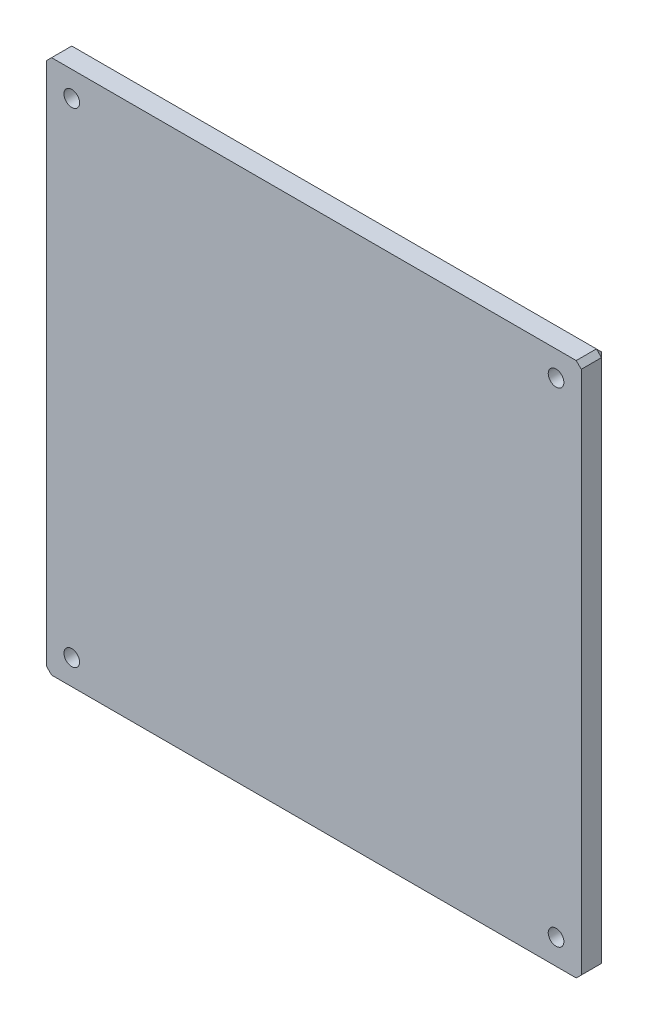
from build123d import *

# Parameters (mm, degrees)
SKETCH1_W           = 106
SKETCH1_H           = 106
BOSS_EXTRUDE1_DEPTH = 5
SKETCH2_R           = 1.55
CUT_EXTRUDE1_DEPTH  = 10
CHAMFER2_SIZE       = 2
CHAMFER3_SIZE       = 2
CHAMFER4_SIZE       = 1


with BuildPart() as part:
    # Sketch1 → Boss-Extrude1 (new body)
    with BuildSketch(Plane.XY):
        Rectangle(SKETCH1_W, SKETCH1_H)
    extrude(amount=BOSS_EXTRUDE1_DEPTH)

    # Sketch2 → Cut-Extrude1 (cut)
    with BuildSketch(Plane.XY):
        with Locations((-48, 48)):
            Circle(SKETCH2_R)
        with Locations((48, 48)):
            Circle(SKETCH2_R)
        with Locations((-48, -48)):
            Circle(SKETCH2_R)
        with Locations((48, -48)):
            Circle(SKETCH2_R)
    extrude(amount=CUT_EXTRUDE1_DEPTH, mode=Mode.SUBTRACT)

    # Chamfer2
    chamfer2_edges = [part.edges().sort_by_distance(p)[0] for p in [
        (46.45, 48, 0),
    ]]
    chamfer(chamfer2_edges, length=CHAMFER2_SIZE)

    # Chamfer3
    chamfer3_edges = [part.edges().sort_by_distance(p)[0] for p in [
        (-49.55, -48, 0),
        (46.45, -48, 0),
        (-49.55, 48, 0),
    ]]
    chamfer(chamfer3_edges, length=CHAMFER3_SIZE)

    # Chamfer4
    chamfer4_edges = [part.edges().sort_by_distance(p)[0] for p in [
        (0, 53, 0),
        (53, 0, 0),
        (0, -53, 0),
        (-53, 0, 0),
        (-53, 53, 2.5),
        (53, 53, 2.5),
        (53, -53, 2.5),
        (-53, -53, 2.5),
    ]]
    chamfer(chamfer4_edges, length=CHAMFER4_SIZE)


solid = part.part
